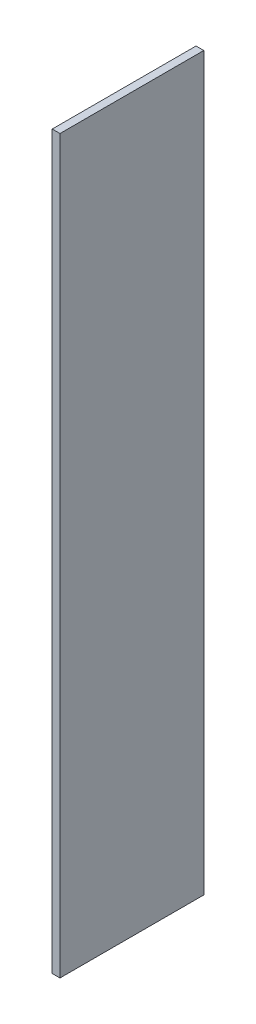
ISO-10303-21;
HEADER;
FILE_DESCRIPTION(('STEP AP214'),'2;1');
FILE_NAME('part.step','',(''),(''),'','','');
FILE_SCHEMA(('AUTOMOTIVE_DESIGN { 1 0 10303 214 1 1 1 1 }'));
ENDSEC;
DATA;
#1=APPLICATION_CONTEXT('core data for automotive mechanical design processes');
#2=APPLICATION_PROTOCOL_DEFINITION('international standard','automotive_design',2000,#1);
#3=PRODUCT_CONTEXT('',#1,'mechanical');
#4=PRODUCT('Part','Part','',(#3));
#5=PRODUCT_RELATED_PRODUCT_CATEGORY('part','',(#4));
#6=PRODUCT_DEFINITION_FORMATION('','',#4);
#7=PRODUCT_DEFINITION_CONTEXT('part definition',#1,'design');
#8=PRODUCT_DEFINITION('design','',#6,#7);
#9=PRODUCT_DEFINITION_SHAPE('','',#8);
#10=(LENGTH_UNIT() NAMED_UNIT(*) SI_UNIT(.MILLI.,.METRE.));
#11=(NAMED_UNIT(*) PLANE_ANGLE_UNIT() SI_UNIT($,.RADIAN.));
#12=(NAMED_UNIT(*) SI_UNIT($,.STERADIAN.) SOLID_ANGLE_UNIT());
#13=UNCERTAINTY_MEASURE_WITH_UNIT(LENGTH_MEASURE(1.E-05),#10,'distance_accuracy_value','');
#14=(GEOMETRIC_REPRESENTATION_CONTEXT(3) GLOBAL_UNCERTAINTY_ASSIGNED_CONTEXT((#13)) GLOBAL_UNIT_ASSIGNED_CONTEXT((#10,
#11,#12)) REPRESENTATION_CONTEXT('',''));
#15=CARTESIAN_POINT('',(0.,0.,0.));
#16=DIRECTION('',(0.,0.,1.));
#17=DIRECTION('',(1.,0.,0.));
#18=AXIS2_PLACEMENT_3D('',#15,#16,#17);
#19=CARTESIAN_POINT('',(3.048,143.51,-28.2194));
#20=DIRECTION('',(0.,0.,1.));
#21=DIRECTION('',(0.,-1.,0.));
#22=AXIS2_PLACEMENT_3D('',#19,#20,#21);
#23=PLANE('',#22);
#24=DIRECTION('',(0.,1.,0.));
#25=VECTOR('',#24,1.);
#26=CARTESIAN_POINT('',(0.,143.51,-28.2194));
#27=LINE('',#26,#25);
#28=CARTESIAN_POINT('',(0.,-143.51,-28.2194));
#29=VERTEX_POINT('',#28);
#30=CARTESIAN_POINT('',(0.,143.51,-28.2194));
#31=VERTEX_POINT('',#30);
#32=EDGE_CURVE('E96',#29,#31,#27,.T.);
#33=ORIENTED_EDGE('',*,*,#32,.T.);
#34=DIRECTION('',(-1.,0.,0.));
#35=VECTOR('',#34,1.);
#36=CARTESIAN_POINT('',(3.048,143.51,-28.2194));
#37=LINE('',#36,#35);
#38=CARTESIAN_POINT('',(3.048,143.51,-28.2194));
#39=VERTEX_POINT('',#38);
#40=EDGE_CURVE('E11',#39,#31,#37,.T.);
#41=ORIENTED_EDGE('',*,*,#40,.F.);
#42=DIRECTION('',(0.,1.,0.));
#43=VECTOR('',#42,1.);
#44=CARTESIAN_POINT('',(3.048,143.51,-28.2194));
#45=LINE('',#44,#43);
#46=CARTESIAN_POINT('',(3.048,-143.51,-28.2194));
#47=VERTEX_POINT('',#46);
#48=EDGE_CURVE('E84',#47,#39,#45,.T.);
#49=ORIENTED_EDGE('',*,*,#48,.F.);
#50=DIRECTION('',(-1.,0.,0.));
#51=VECTOR('',#50,1.);
#52=CARTESIAN_POINT('',(3.048,-143.51,-28.2194));
#53=LINE('',#52,#51);
#54=EDGE_CURVE('E92',#47,#29,#53,.T.);
#55=ORIENTED_EDGE('',*,*,#54,.T.);
#56=EDGE_LOOP('',(#33,#41,#49,#55));
#57=FACE_BOUND('',#56,.T.);
#58=ADVANCED_FACE('F33',(#57),#23,.F.);
#59=CARTESIAN_POINT('',(3.048,143.51,28.2194));
#60=DIRECTION('',(0.,-1.,0.));
#61=DIRECTION('',(0.,0.,-1.));
#62=AXIS2_PLACEMENT_3D('',#59,#60,#61);
#63=PLANE('',#62);
#64=DIRECTION('',(0.,0.,1.));
#65=VECTOR('',#64,1.);
#66=CARTESIAN_POINT('',(0.,143.51,28.2194));
#67=LINE('',#66,#65);
#68=CARTESIAN_POINT('',(0.,143.51,28.2194));
#69=VERTEX_POINT('',#68);
#70=EDGE_CURVE('E88',#31,#69,#67,.T.);
#71=ORIENTED_EDGE('',*,*,#70,.T.);
#72=DIRECTION('',(-1.,0.,0.));
#73=VECTOR('',#72,1.);
#74=CARTESIAN_POINT('',(3.048,143.51,28.2194));
#75=LINE('',#74,#73);
#76=CARTESIAN_POINT('',(3.048,143.51,28.2194));
#77=VERTEX_POINT('',#76);
#78=EDGE_CURVE('E41',#77,#69,#75,.T.);
#79=ORIENTED_EDGE('',*,*,#78,.F.);
#80=DIRECTION('',(0.,0.,1.));
#81=VECTOR('',#80,1.);
#82=CARTESIAN_POINT('',(3.048,143.51,28.2194));
#83=LINE('',#82,#81);
#84=EDGE_CURVE('E79',#39,#77,#83,.T.);
#85=ORIENTED_EDGE('',*,*,#84,.F.);
#86=ORIENTED_EDGE('',*,*,#40,.T.);
#87=EDGE_LOOP('',(#71,#79,#85,#86));
#88=FACE_BOUND('',#87,.T.);
#89=ADVANCED_FACE('F87',(#88),#63,.F.);
#90=CARTESIAN_POINT('',(3.048,143.51,28.2194));
#91=DIRECTION('',(0.,0.,-1.));
#92=DIRECTION('',(0.,1.,0.));
#93=AXIS2_PLACEMENT_3D('',#90,#91,#92);
#94=PLANE('',#93);
#95=DIRECTION('',(0.,-1.,0.));
#96=VECTOR('',#95,1.);
#97=CARTESIAN_POINT('',(0.,143.51,28.2194));
#98=LINE('',#97,#96);
#99=CARTESIAN_POINT('',(0.,-143.51,28.2194));
#100=VERTEX_POINT('',#99);
#101=EDGE_CURVE('E66',#69,#100,#98,.T.);
#102=ORIENTED_EDGE('',*,*,#101,.T.);
#103=DIRECTION('',(-1.,0.,0.));
#104=VECTOR('',#103,1.);
#105=CARTESIAN_POINT('',(3.048,-143.51,28.2194));
#106=LINE('',#105,#104);
#107=CARTESIAN_POINT('',(3.048,-143.51,28.2194));
#108=VERTEX_POINT('',#107);
#109=EDGE_CURVE('E89',#108,#100,#106,.T.);
#110=ORIENTED_EDGE('',*,*,#109,.F.);
#111=DIRECTION('',(0.,-1.,0.));
#112=VECTOR('',#111,1.);
#113=CARTESIAN_POINT('',(3.048,143.51,28.2194));
#114=LINE('',#113,#112);
#115=EDGE_CURVE('E82',#77,#108,#114,.T.);
#116=ORIENTED_EDGE('',*,*,#115,.F.);
#117=ORIENTED_EDGE('',*,*,#78,.T.);
#118=EDGE_LOOP('',(#102,#110,#116,#117));
#119=FACE_BOUND('',#118,.T.);
#120=ADVANCED_FACE('F90',(#119),#94,.F.);
#121=CARTESIAN_POINT('',(3.048,-143.51,28.2194));
#122=DIRECTION('',(0.,1.,0.));
#123=DIRECTION('',(0.,0.,1.));
#124=AXIS2_PLACEMENT_3D('',#121,#122,#123);
#125=PLANE('',#124);
#126=DIRECTION('',(0.,0.,-1.));
#127=VECTOR('',#126,1.);
#128=CARTESIAN_POINT('',(0.,-143.51,28.2194));
#129=LINE('',#128,#127);
#130=EDGE_CURVE('E72',#100,#29,#129,.T.);
#131=ORIENTED_EDGE('',*,*,#130,.T.);
#132=ORIENTED_EDGE('',*,*,#54,.F.);
#133=DIRECTION('',(0.,0.,-1.));
#134=VECTOR('',#133,1.);
#135=CARTESIAN_POINT('',(3.048,-143.51,28.2194));
#136=LINE('',#135,#134);
#137=EDGE_CURVE('E49',#108,#47,#136,.T.);
#138=ORIENTED_EDGE('',*,*,#137,.F.);
#139=ORIENTED_EDGE('',*,*,#109,.T.);
#140=EDGE_LOOP('',(#131,#132,#138,#139));
#141=FACE_BOUND('',#140,.T.);
#142=ADVANCED_FACE('F103',(#141),#125,.F.);
#143=CARTESIAN_POINT('',(3.048,0.,0.));
#144=DIRECTION('',(1.,0.,0.));
#145=DIRECTION('',(0.,0.,-1.));
#146=AXIS2_PLACEMENT_3D('',#143,#144,#145);
#147=PLANE('',#146);
#148=ORIENTED_EDGE('',*,*,#48,.T.);
#149=ORIENTED_EDGE('',*,*,#84,.T.);
#150=ORIENTED_EDGE('',*,*,#115,.T.);
#151=ORIENTED_EDGE('',*,*,#137,.T.);
#152=EDGE_LOOP('',(#148,#149,#150,#151));
#153=FACE_BOUND('',#152,.T.);
#154=ADVANCED_FACE('F80',(#153),#147,.T.);
#155=CARTESIAN_POINT('',(0.,0.,0.));
#156=DIRECTION('',(1.,0.,0.));
#157=DIRECTION('',(0.,0.,-1.));
#158=AXIS2_PLACEMENT_3D('',#155,#156,#157);
#159=PLANE('',#158);
#160=ORIENTED_EDGE('',*,*,#32,.F.);
#161=ORIENTED_EDGE('',*,*,#130,.F.);
#162=ORIENTED_EDGE('',*,*,#101,.F.);
#163=ORIENTED_EDGE('',*,*,#70,.F.);
#164=EDGE_LOOP('',(#160,#161,#162,#163));
#165=FACE_BOUND('',#164,.T.);
#166=ADVANCED_FACE('F106',(#165),#159,.F.);
#167=CLOSED_SHELL('',(#58,#89,#120,#142,#154,#166));
#168=MANIFOLD_SOLID_BREP('B2',#167);
#169=ADVANCED_BREP_SHAPE_REPRESENTATION('',(#18,#168),#14);
#170=SHAPE_DEFINITION_REPRESENTATION(#9,#169);
ENDSEC;
END-ISO-10303-21;
